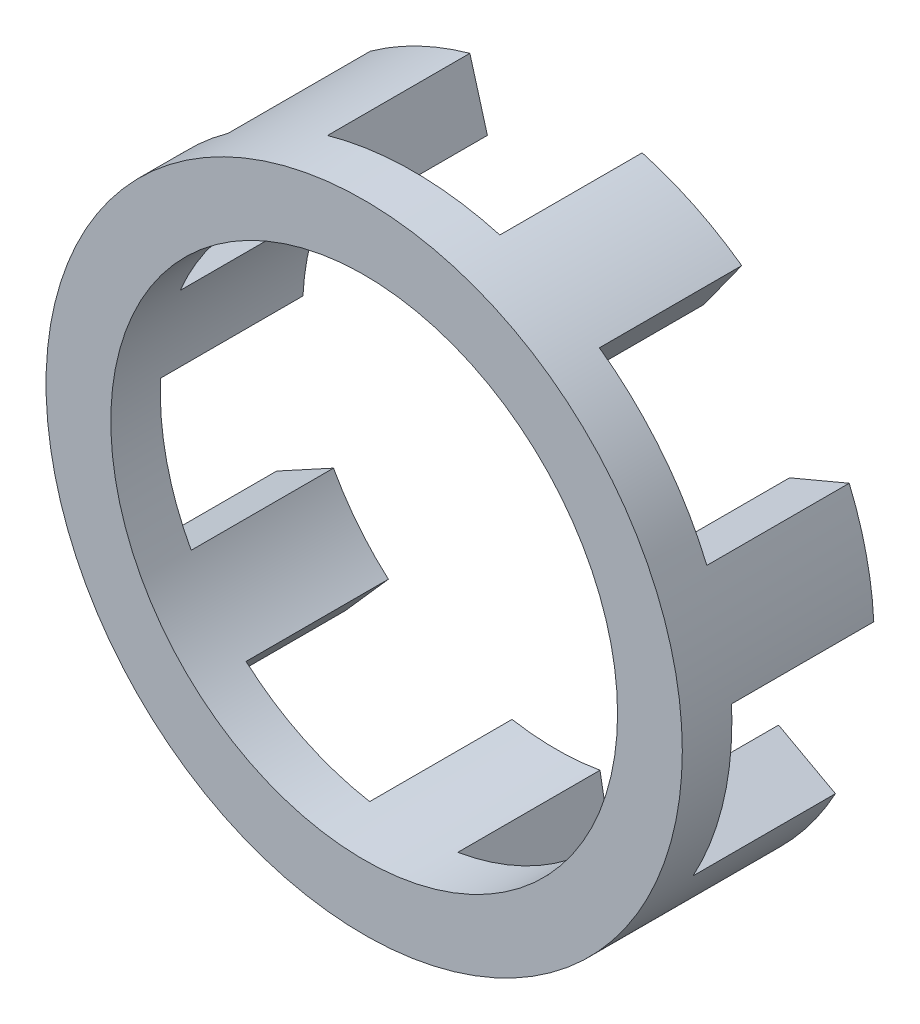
ISO-10303-21;
HEADER;
FILE_DESCRIPTION(('STEP AP214'),'2;1');
FILE_NAME('part.step','',(''),(''),'','','');
FILE_SCHEMA(('AUTOMOTIVE_DESIGN { 1 0 10303 214 1 1 1 1 }'));
ENDSEC;
DATA;
#1=APPLICATION_CONTEXT('core data for automotive mechanical design processes');
#2=APPLICATION_PROTOCOL_DEFINITION('international standard','automotive_design',2000,#1);
#3=PRODUCT_CONTEXT('',#1,'mechanical');
#4=PRODUCT('Part','Part','',(#3));
#5=PRODUCT_RELATED_PRODUCT_CATEGORY('part','',(#4));
#6=PRODUCT_DEFINITION_FORMATION('','',#4);
#7=PRODUCT_DEFINITION_CONTEXT('part definition',#1,'design');
#8=PRODUCT_DEFINITION('design','',#6,#7);
#9=PRODUCT_DEFINITION_SHAPE('','',#8);
#10=(LENGTH_UNIT() NAMED_UNIT(*) SI_UNIT(.MILLI.,.METRE.));
#11=(NAMED_UNIT(*) PLANE_ANGLE_UNIT() SI_UNIT($,.RADIAN.));
#12=(NAMED_UNIT(*) SI_UNIT($,.STERADIAN.) SOLID_ANGLE_UNIT());
#13=UNCERTAINTY_MEASURE_WITH_UNIT(LENGTH_MEASURE(1.E-05),#10,'distance_accuracy_value','');
#14=(GEOMETRIC_REPRESENTATION_CONTEXT(3) GLOBAL_UNCERTAINTY_ASSIGNED_CONTEXT((#13)) GLOBAL_UNIT_ASSIGNED_CONTEXT((#10,
#11,#12)) REPRESENTATION_CONTEXT('',''));
#15=CARTESIAN_POINT('',(0.,0.,0.));
#16=DIRECTION('',(0.,0.,1.));
#17=DIRECTION('',(1.,0.,0.));
#18=AXIS2_PLACEMENT_3D('',#15,#16,#17);
#19=CARTESIAN_POINT('',(-0.0364276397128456,-0.0594127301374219,-1.26999999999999));
#20=DIRECTION('',(0.,0.,1.));
#21=DIRECTION('',(1.,0.,0.));
#22=AXIS2_PLACEMENT_3D('',#19,#20,#21);
#23=PLANE('',#22);
#24=CARTESIAN_POINT('',(-0.0364276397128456,-0.0594127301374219,-1.26999999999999));
#25=DIRECTION('',(0.,0.,1.));
#26=DIRECTION('',(1.,0.,0.));
#27=AXIS2_PLACEMENT_3D('',#24,#25,#26);
#28=CIRCLE('',#27,6.49984127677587);
#29=CARTESIAN_POINT('',(-4.33728055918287,-4.93287154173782,-1.26999999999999));
#30=VERTEX_POINT('',#29);
#31=CARTESIAN_POINT('',(-1.16511323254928,-6.46050681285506,-1.26999999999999));
#32=VERTEX_POINT('',#31);
#33=EDGE_CURVE('E56',#30,#32,#28,.T.);
#34=ORIENTED_EDGE('',*,*,#33,.T.);
#35=DIRECTION('',(0.173648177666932,0.984807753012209,0.));
#36=VECTOR('',#35,1.);
#37=CARTESIAN_POINT('',(-1.16511323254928,-6.46050681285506,-1.26999999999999));
#38=LINE('',#37,#36);
#39=CARTESIAN_POINT('',(-1.45352780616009,-8.09618714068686,-1.26999999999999));
#40=VERTEX_POINT('',#39);
#41=EDGE_CURVE('E244',#40,#32,#38,.T.);
#42=ORIENTED_EDGE('',*,*,#41,.F.);
#43=CARTESIAN_POINT('',(-0.0364276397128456,-0.0594127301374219,-1.26999999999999));
#44=DIRECTION('',(0.,0.,1.));
#45=DIRECTION('',(1.,0.,0.));
#46=AXIS2_PLACEMENT_3D('',#43,#44,#45);
#47=CIRCLE('',#46,8.16075461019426);
#48=CARTESIAN_POINT('',(-5.4362833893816,-6.17819313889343,-1.26999999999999));
#49=VERTEX_POINT('',#48);
#50=EDGE_CURVE('E42',#49,#40,#47,.T.);
#51=ORIENTED_EDGE('',*,*,#50,.F.);
#52=DIRECTION('',(-0.661685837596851,-0.749781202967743,0.));
#53=VECTOR('',#52,1.);
#54=CARTESIAN_POINT('',(-4.33728055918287,-4.93287154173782,-1.26999999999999));
#55=LINE('',#54,#53);
#56=EDGE_CURVE('E375',#30,#49,#55,.T.);
#57=ORIENTED_EDGE('',*,*,#56,.F.);
#58=EDGE_LOOP('',(#34,#42,#51,#57));
#59=FACE_BOUND('',#58,.T.);
#60=ADVANCED_FACE('F38',(#59),#23,.F.);
#61=CARTESIAN_POINT('',(-4.33728055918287,-4.93287154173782,-4.92125000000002));
#62=DIRECTION('',(-0.749781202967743,0.66168583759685,0.));
#63=DIRECTION('',(-0.661685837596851,-0.749781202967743,0.));
#64=AXIS2_PLACEMENT_3D('',#61,#62,#63);
#65=PLANE('',#64);
#66=ORIENTED_EDGE('',*,*,#56,.T.);
#67=DIRECTION('',(0.,0.,1.));
#68=VECTOR('',#67,1.);
#69=CARTESIAN_POINT('',(-5.4362833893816,-6.17819313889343,-4.92125000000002));
#70=LINE('',#69,#68);
#71=CARTESIAN_POINT('',(-5.4362833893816,-6.17819313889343,-4.92125000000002));
#72=VERTEX_POINT('',#71);
#73=EDGE_CURVE('E48',#72,#49,#70,.T.);
#74=ORIENTED_EDGE('',*,*,#73,.F.);
#75=DIRECTION('',(-0.661685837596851,-0.749781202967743,0.));
#76=VECTOR('',#75,1.);
#77=CARTESIAN_POINT('',(-4.33728055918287,-4.93287154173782,-4.92125000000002));
#78=LINE('',#77,#76);
#79=CARTESIAN_POINT('',(-4.33728055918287,-4.93287154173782,-4.92125000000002));
#80=VERTEX_POINT('',#79);
#81=EDGE_CURVE('E398',#80,#72,#78,.T.);
#82=ORIENTED_EDGE('',*,*,#81,.F.);
#83=DIRECTION('',(0.,0.,1.));
#84=VECTOR('',#83,1.);
#85=CARTESIAN_POINT('',(-4.33728055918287,-4.93287154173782,-4.92125000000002));
#86=LINE('',#85,#84);
#87=EDGE_CURVE('E11',#80,#30,#86,.T.);
#88=ORIENTED_EDGE('',*,*,#87,.T.);
#89=EDGE_LOOP('',(#66,#74,#82,#88));
#90=FACE_BOUND('',#89,.T.);
#91=ADVANCED_FACE('F40',(#90),#65,.F.);
#92=CARTESIAN_POINT('',(-5.74472847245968,-3.16798768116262,-4.92125000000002));
#93=DIRECTION('',(0.478253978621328,-0.878221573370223,0.));
#94=DIRECTION('',(0.878221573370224,0.478253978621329,0.));
#95=AXIS2_PLACEMENT_3D('',#92,#93,#94);
#96=PLANE('',#95);
#97=DIRECTION('',(0.878221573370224,0.478253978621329,0.));
#98=VECTOR('',#97,1.);
#99=CARTESIAN_POINT('',(-5.74472847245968,-3.16798768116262,-1.26999999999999));
#100=LINE('',#99,#98);
#101=CARTESIAN_POINT('',(-7.20337839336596,-3.96232609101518,-1.26999999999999));
#102=VERTEX_POINT('',#101);
#103=CARTESIAN_POINT('',(-5.74472847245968,-3.16798768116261,-1.26999999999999));
#104=VERTEX_POINT('',#103);
#105=EDGE_CURVE('E389',#102,#104,#100,.T.);
#106=ORIENTED_EDGE('',*,*,#105,.T.);
#107=DIRECTION('',(0.,0.,1.));
#108=VECTOR('',#107,1.);
#109=CARTESIAN_POINT('',(-5.74472847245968,-3.16798768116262,-4.92125000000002));
#110=LINE('',#109,#108);
#111=CARTESIAN_POINT('',(-5.74472847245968,-3.16798768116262,-4.92125000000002));
#112=VERTEX_POINT('',#111);
#113=EDGE_CURVE('E384',#112,#104,#110,.T.);
#114=ORIENTED_EDGE('',*,*,#113,.F.);
#115=DIRECTION('',(0.878221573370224,0.478253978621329,0.));
#116=VECTOR('',#115,1.);
#117=CARTESIAN_POINT('',(-5.74472847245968,-3.16798768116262,-4.92125000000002));
#118=LINE('',#117,#116);
#119=CARTESIAN_POINT('',(-7.20337839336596,-3.96232609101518,-4.92125000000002));
#120=VERTEX_POINT('',#119);
#121=EDGE_CURVE('E394',#120,#112,#118,.T.);
#122=ORIENTED_EDGE('',*,*,#121,.F.);
#123=DIRECTION('',(0.,0.,1.));
#124=VECTOR('',#123,1.);
#125=CARTESIAN_POINT('',(-7.20337839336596,-3.96232609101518,-4.92125000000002));
#126=LINE('',#125,#124);
#127=EDGE_CURVE('E379',#120,#102,#126,.T.);
#128=ORIENTED_EDGE('',*,*,#127,.T.);
#129=EDGE_LOOP('',(#106,#114,#122,#128));
#130=FACE_BOUND('',#129,.T.);
#131=ADVANCED_FACE('F413',(#130),#96,.F.);
#132=CARTESIAN_POINT('',(-0.0364276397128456,-0.0594127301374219,-4.92124999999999));
#133=DIRECTION('',(0.,0.,-1.));
#134=DIRECTION('',(-0.623489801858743,0.781831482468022,0.));
#135=AXIS2_PLACEMENT_3D('',#132,#133,#134);
#136=PLANE('',#135);
#137=CARTESIAN_POINT('',(-0.0364276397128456,-0.0594127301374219,-4.92124999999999));
#138=DIRECTION('',(0.,0.,1.));
#139=DIRECTION('',(-0.623489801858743,0.781831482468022,0.));
#140=AXIS2_PLACEMENT_3D('',#137,#138,#139);
#141=CIRCLE('',#140,6.49984127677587);
#142=EDGE_CURVE('E311',#112,#80,#141,.T.);
#143=ORIENTED_EDGE('',*,*,#142,.T.);
#144=ORIENTED_EDGE('',*,*,#81,.T.);
#145=CARTESIAN_POINT('',(-0.0364276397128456,-0.0594127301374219,-4.92124999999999));
#146=DIRECTION('',(0.,0.,-1.));
#147=DIRECTION('',(-0.623489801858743,0.781831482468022,0.));
#148=AXIS2_PLACEMENT_3D('',#145,#146,#147);
#149=CIRCLE('',#148,8.16075461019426);
#150=EDGE_CURVE('E397',#72,#120,#149,.T.);
#151=ORIENTED_EDGE('',*,*,#150,.T.);
#152=ORIENTED_EDGE('',*,*,#121,.T.);
#153=EDGE_LOOP('',(#143,#144,#151,#152));
#154=FACE_BOUND('',#153,.T.);
#155=ADVANCED_FACE('F402',(#154),#136,.T.);
#156=CARTESIAN_POINT('',(-6.52818910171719,0.264577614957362,-1.26999999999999));
#157=VERTEX_POINT('',#156);
#158=EDGE_CURVE('E302',#157,#104,#28,.T.);
#159=ORIENTED_EDGE('',*,*,#158,.T.);
#160=ORIENTED_EDGE('',*,*,#105,.F.);
#161=CARTESIAN_POINT('',(-8.1870377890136,0.347367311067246,-1.26999999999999));
#162=VERTEX_POINT('',#161);
#163=EDGE_CURVE('E305',#162,#102,#47,.T.);
#164=ORIENTED_EDGE('',*,*,#163,.F.);
#165=DIRECTION('',(-0.998756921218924,0.0498458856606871,0.));
#166=VECTOR('',#165,1.);
#167=CARTESIAN_POINT('',(-6.52818910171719,0.264577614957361,-1.26999999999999));
#168=LINE('',#167,#166);
#169=EDGE_CURVE('E352',#157,#162,#168,.T.);
#170=ORIENTED_EDGE('',*,*,#169,.F.);
#171=EDGE_LOOP('',(#159,#160,#164,#170));
#172=FACE_BOUND('',#171,.T.);
#173=ADVANCED_FACE('F417',(#172),#23,.F.);
#174=CARTESIAN_POINT('',(-6.52818910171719,0.264577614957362,-4.92125000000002));
#175=DIRECTION('',(0.049845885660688,0.998756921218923,0.));
#176=DIRECTION('',(-0.998756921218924,0.0498458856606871,0.));
#177=AXIS2_PLACEMENT_3D('',#174,#175,#176);
#178=PLANE('',#177);
#179=ORIENTED_EDGE('',*,*,#169,.T.);
#180=DIRECTION('',(0.,0.,1.));
#181=VECTOR('',#180,1.);
#182=CARTESIAN_POINT('',(-8.1870377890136,0.347367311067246,-4.92125000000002));
#183=LINE('',#182,#181);
#184=CARTESIAN_POINT('',(-8.1870377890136,0.347367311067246,-4.92125000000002));
#185=VERTEX_POINT('',#184);
#186=EDGE_CURVE('E357',#185,#162,#183,.T.);
#187=ORIENTED_EDGE('',*,*,#186,.F.);
#188=DIRECTION('',(-0.998756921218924,0.0498458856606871,0.));
#189=VECTOR('',#188,1.);
#190=CARTESIAN_POINT('',(-6.52818910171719,0.264577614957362,-4.92125000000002));
#191=LINE('',#190,#189);
#192=CARTESIAN_POINT('',(-6.52818910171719,0.264577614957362,-4.92125000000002));
#193=VERTEX_POINT('',#192);
#194=EDGE_CURVE('E332',#193,#185,#191,.T.);
#195=ORIENTED_EDGE('',*,*,#194,.F.);
#196=DIRECTION('',(0.,0.,1.));
#197=VECTOR('',#196,1.);
#198=CARTESIAN_POINT('',(-6.52818910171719,0.264577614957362,-4.92125000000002));
#199=LINE('',#198,#197);
#200=EDGE_CURVE('E362',#193,#157,#199,.T.);
#201=ORIENTED_EDGE('',*,*,#200,.T.);
#202=EDGE_LOOP('',(#179,#187,#195,#201));
#203=FACE_BOUND('',#202,.T.);
#204=ADVANCED_FACE('F419',(#203),#178,.F.);
#205=CARTESIAN_POINT('',(-6.02587675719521,2.46535179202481,-4.92124999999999));
#206=DIRECTION('',(-0.388434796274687,-0.921476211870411,0.));
#207=DIRECTION('',(0.921476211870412,-0.388434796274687,0.));
#208=AXIS2_PLACEMENT_3D('',#205,#206,#207);
#209=PLANE('',#208);
#210=DIRECTION('',(0.921476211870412,-0.388434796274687,0.));
#211=VECTOR('',#210,1.);
#212=CARTESIAN_POINT('',(-6.02587675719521,2.46535179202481,-1.26999999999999));
#213=LINE('',#212,#211);
#214=CARTESIAN_POINT('',(-7.55636888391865,3.1105083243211,-1.26999999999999));
#215=VERTEX_POINT('',#214);
#216=CARTESIAN_POINT('',(-6.02587675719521,2.46535179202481,-1.26999999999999));
#217=VERTEX_POINT('',#216);
#218=EDGE_CURVE('E339',#215,#217,#213,.T.);
#219=ORIENTED_EDGE('',*,*,#218,.T.);
#220=DIRECTION('',(0.,0.,1.));
#221=VECTOR('',#220,1.);
#222=CARTESIAN_POINT('',(-6.02587675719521,2.46535179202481,-4.92124999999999));
#223=LINE('',#222,#221);
#224=CARTESIAN_POINT('',(-6.02587675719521,2.46535179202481,-4.92124999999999));
#225=VERTEX_POINT('',#224);
#226=EDGE_CURVE('E342',#225,#217,#223,.T.);
#227=ORIENTED_EDGE('',*,*,#226,.F.);
#228=DIRECTION('',(0.921476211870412,-0.388434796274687,0.));
#229=VECTOR('',#228,1.);
#230=CARTESIAN_POINT('',(-6.02587675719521,2.46535179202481,-4.92124999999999));
#231=LINE('',#230,#229);
#232=CARTESIAN_POINT('',(-7.55636888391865,3.1105083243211,-4.92124999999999));
#233=VERTEX_POINT('',#232);
#234=EDGE_CURVE('E336',#233,#225,#231,.T.);
#235=ORIENTED_EDGE('',*,*,#234,.F.);
#236=DIRECTION('',(0.,0.,1.));
#237=VECTOR('',#236,1.);
#238=CARTESIAN_POINT('',(-7.55636888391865,3.1105083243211,-4.92124999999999));
#239=LINE('',#238,#237);
#240=EDGE_CURVE('E347',#233,#215,#239,.T.);
#241=ORIENTED_EDGE('',*,*,#240,.T.);
#242=EDGE_LOOP('',(#219,#227,#235,#241));
#243=FACE_BOUND('',#242,.T.);
#244=ADVANCED_FACE('F427',(#243),#209,.F.);
#245=CARTESIAN_POINT('',(-0.0364276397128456,-0.0594127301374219,-4.92124999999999));
#246=DIRECTION('',(0.,0.,-1.));
#247=DIRECTION('',(0.222520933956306,0.974927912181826,0.));
#248=AXIS2_PLACEMENT_3D('',#245,#246,#247);
#249=PLANE('',#248);
#250=CARTESIAN_POINT('',(-0.0364276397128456,-0.0594127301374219,-4.92124999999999));
#251=DIRECTION('',(0.,0.,1.));
#252=DIRECTION('',(0.222520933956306,0.974927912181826,0.));
#253=AXIS2_PLACEMENT_3D('',#250,#251,#252);
#254=CIRCLE('',#253,6.49984127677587);
#255=EDGE_CURVE('E310',#225,#193,#254,.T.);
#256=ORIENTED_EDGE('',*,*,#255,.T.);
#257=ORIENTED_EDGE('',*,*,#194,.T.);
#258=CARTESIAN_POINT('',(-0.0364276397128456,-0.0594127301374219,-4.92124999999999));
#259=DIRECTION('',(0.,0.,-1.));
#260=DIRECTION('',(0.222520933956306,0.974927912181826,0.));
#261=AXIS2_PLACEMENT_3D('',#258,#259,#260);
#262=CIRCLE('',#261,8.16075461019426);
#263=EDGE_CURVE('E334',#185,#233,#262,.T.);
#264=ORIENTED_EDGE('',*,*,#263,.T.);
#265=ORIENTED_EDGE('',*,*,#234,.T.);
#266=EDGE_LOOP('',(#256,#257,#264,#265));
#267=FACE_BOUND('',#266,.T.);
#268=ADVANCED_FACE('F424',(#267),#249,.T.);
#269=CARTESIAN_POINT('',(-3.8306688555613,5.21805543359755,-1.26999999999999));
#270=VERTEX_POINT('',#269);
#271=EDGE_CURVE('E298',#270,#217,#28,.T.);
#272=ORIENTED_EDGE('',*,*,#271,.T.);
#273=ORIENTED_EDGE('',*,*,#218,.F.);
#274=CARTESIAN_POINT('',(-4.80021650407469,6.56661409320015,-1.26999999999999));
#275=VERTEX_POINT('',#274);
#276=EDGE_CURVE('E328',#275,#215,#47,.T.);
#277=ORIENTED_EDGE('',*,*,#276,.F.);
#278=DIRECTION('',(-0.583743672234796,0.811938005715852,0.));
#279=VECTOR('',#278,1.);
#280=CARTESIAN_POINT('',(-3.8306688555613,5.21805543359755,-1.26999999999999));
#281=LINE('',#280,#279);
#282=EDGE_CURVE('E435',#270,#275,#281,.T.);
#283=ORIENTED_EDGE('',*,*,#282,.F.);
#284=EDGE_LOOP('',(#272,#273,#277,#283));
#285=FACE_BOUND('',#284,.T.);
#286=ADVANCED_FACE('F436',(#285),#23,.F.);
#287=CARTESIAN_POINT('',(-3.8306688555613,5.21805543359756,-4.92124999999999));
#288=DIRECTION('',(0.811938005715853,0.583743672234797,0.));
#289=DIRECTION('',(-0.583743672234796,0.811938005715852,0.));
#290=AXIS2_PLACEMENT_3D('',#287,#288,#289);
#291=PLANE('',#290);
#292=ORIENTED_EDGE('',*,*,#282,.T.);
#293=DIRECTION('',(0.,0.,1.));
#294=VECTOR('',#293,1.);
#295=CARTESIAN_POINT('',(-4.80021650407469,6.56661409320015,-4.92124999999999));
#296=LINE('',#295,#294);
#297=CARTESIAN_POINT('',(-4.80021650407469,6.56661409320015,-4.92124999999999));
#298=VERTEX_POINT('',#297);
#299=EDGE_CURVE('E440',#298,#275,#296,.T.);
#300=ORIENTED_EDGE('',*,*,#299,.F.);
#301=DIRECTION('',(-0.583743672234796,0.811938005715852,0.));
#302=VECTOR('',#301,1.);
#303=CARTESIAN_POINT('',(-3.8306688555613,5.21805543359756,-4.92124999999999));
#304=LINE('',#303,#302);
#305=CARTESIAN_POINT('',(-3.8306688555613,5.21805543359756,-4.92124999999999));
#306=VERTEX_POINT('',#305);
#307=EDGE_CURVE('E445',#306,#298,#304,.T.);
#308=ORIENTED_EDGE('',*,*,#307,.F.);
#309=DIRECTION('',(0.,0.,1.));
#310=VECTOR('',#309,1.);
#311=CARTESIAN_POINT('',(-3.8306688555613,5.21805543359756,-4.92124999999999));
#312=LINE('',#311,#310);
#313=EDGE_CURVE('E306',#306,#270,#312,.T.);
#314=ORIENTED_EDGE('',*,*,#313,.T.);
#315=EDGE_LOOP('',(#292,#300,#308,#314));
#316=FACE_BOUND('',#315,.T.);
#317=ADVANCED_FACE('F444',(#316),#291,.F.);
#318=CARTESIAN_POINT('',(-1.79684769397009,6.19749208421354,-4.92124999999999));
#319=DIRECTION('',(-0.962624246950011,-0.270840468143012,0.));
#320=DIRECTION('',(0.270840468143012,-0.962624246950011,0.));
#321=AXIS2_PLACEMENT_3D('',#318,#319,#320);
#322=PLANE('',#321);
#323=DIRECTION('',(0.270840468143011,-0.96262424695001,0.));
#324=VECTOR('',#323,1.);
#325=CARTESIAN_POINT('',(-1.79684769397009,6.19749208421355,-1.26999999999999));
#326=LINE('',#325,#324);
#327=CARTESIAN_POINT('',(-2.2466902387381,7.79632753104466,-1.26999999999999));
#328=VERTEX_POINT('',#327);
#329=CARTESIAN_POINT('',(-1.79684769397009,6.19749208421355,-1.26999999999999));
#330=VERTEX_POINT('',#329);
#331=EDGE_CURVE('E463',#328,#330,#326,.T.);
#332=ORIENTED_EDGE('',*,*,#331,.T.);
#333=DIRECTION('',(0.,0.,1.));
#334=VECTOR('',#333,1.);
#335=CARTESIAN_POINT('',(-1.79684769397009,6.19749208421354,-4.92124999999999));
#336=LINE('',#335,#334);
#337=CARTESIAN_POINT('',(-1.79684769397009,6.19749208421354,-4.92124999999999));
#338=VERTEX_POINT('',#337);
#339=EDGE_CURVE('E458',#338,#330,#336,.T.);
#340=ORIENTED_EDGE('',*,*,#339,.F.);
#341=DIRECTION('',(0.270840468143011,-0.96262424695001,0.));
#342=VECTOR('',#341,1.);
#343=CARTESIAN_POINT('',(-1.79684769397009,6.19749208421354,-4.92124999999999));
#344=LINE('',#343,#342);
#345=CARTESIAN_POINT('',(-2.2466902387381,7.79632753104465,-4.92124999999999));
#346=VERTEX_POINT('',#345);
#347=EDGE_CURVE('E468',#346,#338,#344,.T.);
#348=ORIENTED_EDGE('',*,*,#347,.F.);
#349=DIRECTION('',(0.,0.,1.));
#350=VECTOR('',#349,1.);
#351=CARTESIAN_POINT('',(-2.2466902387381,7.79632753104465,-4.92124999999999));
#352=LINE('',#351,#350);
#353=EDGE_CURVE('E441',#346,#328,#352,.T.);
#354=ORIENTED_EDGE('',*,*,#353,.T.);
#355=EDGE_LOOP('',(#332,#340,#348,#354));
#356=FACE_BOUND('',#355,.T.);
#357=ADVANCED_FACE('F481',(#356),#322,.F.);
#358=CARTESIAN_POINT('',(-0.0364276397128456,-0.0594127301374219,-4.92124999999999));
#359=DIRECTION('',(0.,0.,-1.));
#360=DIRECTION('',(0.900968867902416,0.433883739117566,0.));
#361=AXIS2_PLACEMENT_3D('',#358,#359,#360);
#362=PLANE('',#361);
#363=CARTESIAN_POINT('',(-0.0364276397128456,-0.0594127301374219,-4.92124999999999));
#364=DIRECTION('',(0.,0.,1.));
#365=DIRECTION('',(0.900968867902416,0.433883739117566,0.));
#366=AXIS2_PLACEMENT_3D('',#363,#364,#365);
#367=CIRCLE('',#366,6.49984127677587);
#368=EDGE_CURVE('E330',#338,#306,#367,.T.);
#369=ORIENTED_EDGE('',*,*,#368,.T.);
#370=ORIENTED_EDGE('',*,*,#307,.T.);
#371=CARTESIAN_POINT('',(-0.0364276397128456,-0.0594127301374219,-4.92124999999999));
#372=DIRECTION('',(0.,0.,-1.));
#373=DIRECTION('',(0.900968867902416,0.433883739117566,0.));
#374=AXIS2_PLACEMENT_3D('',#371,#372,#373);
#375=CIRCLE('',#374,8.16075461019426);
#376=EDGE_CURVE('E471',#298,#346,#375,.T.);
#377=ORIENTED_EDGE('',*,*,#376,.T.);
#378=ORIENTED_EDGE('',*,*,#347,.T.);
#379=EDGE_LOOP('',(#369,#370,#377,#378));
#380=FACE_BOUND('',#379,.T.);
#381=ADVANCED_FACE('F474',(#380),#362,.T.);
#382=CARTESIAN_POINT('',(1.72399241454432,6.19749208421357,-1.26999999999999));
#383=VERTEX_POINT('',#382);
#384=EDGE_CURVE('E294',#383,#330,#28,.T.);
#385=ORIENTED_EDGE('',*,*,#384,.T.);
#386=ORIENTED_EDGE('',*,*,#331,.F.);
#387=CARTESIAN_POINT('',(2.17383495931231,7.79632753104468,-1.26999999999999));
#388=VERTEX_POINT('',#387);
#389=EDGE_CURVE('E326',#388,#328,#47,.T.);
#390=ORIENTED_EDGE('',*,*,#389,.F.);
#391=DIRECTION('',(0.270840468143,0.962624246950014,0.));
#392=VECTOR('',#391,1.);
#393=CARTESIAN_POINT('',(1.72399241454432,6.19749208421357,-1.26999999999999));
#394=LINE('',#393,#392);
#395=EDGE_CURVE('E487',#383,#388,#394,.T.);
#396=ORIENTED_EDGE('',*,*,#395,.F.);
#397=EDGE_LOOP('',(#385,#386,#390,#396));
#398=FACE_BOUND('',#397,.T.);
#399=ADVANCED_FACE('F485',(#398),#23,.F.);
#400=CARTESIAN_POINT('',(1.72399241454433,6.19749208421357,-4.92124999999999));
#401=DIRECTION('',(0.962624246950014,-0.270840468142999,0.));
#402=DIRECTION('',(0.270840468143,0.962624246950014,0.));
#403=AXIS2_PLACEMENT_3D('',#400,#401,#402);
#404=PLANE('',#403);
#405=ORIENTED_EDGE('',*,*,#395,.T.);
#406=DIRECTION('',(0.,0.,1.));
#407=VECTOR('',#406,1.);
#408=CARTESIAN_POINT('',(2.17383495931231,7.79632753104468,-4.92124999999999));
#409=LINE('',#408,#407);
#410=CARTESIAN_POINT('',(2.17383495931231,7.79632753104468,-4.92124999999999));
#411=VERTEX_POINT('',#410);
#412=EDGE_CURVE('E864',#411,#388,#409,.T.);
#413=ORIENTED_EDGE('',*,*,#412,.F.);
#414=DIRECTION('',(0.270840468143,0.962624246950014,0.));
#415=VECTOR('',#414,1.);
#416=CARTESIAN_POINT('',(1.72399241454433,6.19749208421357,-4.92124999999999));
#417=LINE('',#416,#415);
#418=CARTESIAN_POINT('',(1.72399241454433,6.19749208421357,-4.92124999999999));
#419=VERTEX_POINT('',#418);
#420=EDGE_CURVE('E881',#419,#411,#417,.T.);
#421=ORIENTED_EDGE('',*,*,#420,.F.);
#422=DIRECTION('',(0.,0.,1.));
#423=VECTOR('',#422,1.);
#424=CARTESIAN_POINT('',(1.72399241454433,6.19749208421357,-4.92124999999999));
#425=LINE('',#424,#423);
#426=EDGE_CURVE('E433',#419,#383,#425,.T.);
#427=ORIENTED_EDGE('',*,*,#426,.T.);
#428=EDGE_LOOP('',(#405,#413,#421,#427));
#429=FACE_BOUND('',#428,.T.);
#430=ADVANCED_FACE('F630',(#429),#404,.F.);
#431=CARTESIAN_POINT('',(3.75781357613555,5.21805543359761,-4.92124999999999));
#432=DIRECTION('',(-0.81193800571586,0.583743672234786,0.));
#433=DIRECTION('',(-0.583743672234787,-0.81193800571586,0.));
#434=AXIS2_PLACEMENT_3D('',#431,#432,#433);
#435=PLANE('',#434);
#436=DIRECTION('',(-0.583743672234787,-0.81193800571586,0.));
#437=VECTOR('',#436,1.);
#438=CARTESIAN_POINT('',(3.75781357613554,5.21805543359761,-1.26999999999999));
#439=LINE('',#438,#437);
#440=CARTESIAN_POINT('',(4.72736122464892,6.56661409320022,-1.26999999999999));
#441=VERTEX_POINT('',#440);
#442=CARTESIAN_POINT('',(3.75781357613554,5.21805543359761,-1.26999999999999));
#443=VERTEX_POINT('',#442);
#444=EDGE_CURVE('E852',#441,#443,#439,.T.);
#445=ORIENTED_EDGE('',*,*,#444,.T.);
#446=DIRECTION('',(0.,0.,1.));
#447=VECTOR('',#446,1.);
#448=CARTESIAN_POINT('',(3.75781357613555,5.21805543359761,-4.92124999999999));
#449=LINE('',#448,#447);
#450=CARTESIAN_POINT('',(3.75781357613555,5.21805543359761,-4.92124999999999));
#451=VERTEX_POINT('',#450);
#452=EDGE_CURVE('E856',#451,#443,#449,.T.);
#453=ORIENTED_EDGE('',*,*,#452,.F.);
#454=DIRECTION('',(-0.583743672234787,-0.81193800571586,0.));
#455=VECTOR('',#454,1.);
#456=CARTESIAN_POINT('',(3.75781357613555,5.21805543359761,-4.92124999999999));
#457=LINE('',#456,#455);
#458=CARTESIAN_POINT('',(4.72736122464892,6.56661409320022,-4.92124999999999));
#459=VERTEX_POINT('',#458);
#460=EDGE_CURVE('E857',#459,#451,#457,.T.);
#461=ORIENTED_EDGE('',*,*,#460,.F.);
#462=DIRECTION('',(0.,0.,1.));
#463=VECTOR('',#462,1.);
#464=CARTESIAN_POINT('',(4.72736122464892,6.56661409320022,-4.92124999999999));
#465=LINE('',#464,#463);
#466=EDGE_CURVE('E860',#459,#441,#465,.T.);
#467=ORIENTED_EDGE('',*,*,#466,.T.);
#468=EDGE_LOOP('',(#445,#453,#461,#467));
#469=FACE_BOUND('',#468,.T.);
#470=ADVANCED_FACE('F626',(#469),#435,.F.);
#471=CARTESIAN_POINT('',(-0.0364276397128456,-0.0594127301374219,-4.92124999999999));
#472=DIRECTION('',(0.,0.,-1.));
#473=DIRECTION('',(0.900968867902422,-0.433883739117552,0.));
#474=AXIS2_PLACEMENT_3D('',#471,#472,#473);
#475=PLANE('',#474);
#476=CARTESIAN_POINT('',(-0.0364276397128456,-0.0594127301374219,-4.92124999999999));
#477=DIRECTION('',(0.,0.,1.));
#478=DIRECTION('',(0.900968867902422,-0.433883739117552,0.));
#479=AXIS2_PLACEMENT_3D('',#476,#477,#478);
#480=CIRCLE('',#479,6.49984127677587);
#481=EDGE_CURVE('E490',#451,#419,#480,.T.);
#482=ORIENTED_EDGE('',*,*,#481,.T.);
#483=ORIENTED_EDGE('',*,*,#420,.T.);
#484=CARTESIAN_POINT('',(-0.0364276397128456,-0.0594127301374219,-4.92124999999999));
#485=DIRECTION('',(0.,0.,-1.));
#486=DIRECTION('',(0.900968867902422,-0.433883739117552,0.));
#487=AXIS2_PLACEMENT_3D('',#484,#485,#486);
#488=CIRCLE('',#487,8.16075461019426);
#489=EDGE_CURVE('E882',#411,#459,#488,.T.);
#490=ORIENTED_EDGE('',*,*,#489,.T.);
#491=ORIENTED_EDGE('',*,*,#460,.T.);
#492=EDGE_LOOP('',(#482,#483,#490,#491));
#493=FACE_BOUND('',#492,.T.);
#494=ADVANCED_FACE('F620',(#493),#475,.T.);
#495=CARTESIAN_POINT('',(5.95302147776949,2.46535179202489,-1.26999999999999));
#496=VERTEX_POINT('',#495);
#497=EDGE_CURVE('E289',#496,#443,#28,.T.);
#498=ORIENTED_EDGE('',*,*,#497,.T.);
#499=ORIENTED_EDGE('',*,*,#444,.F.);
#500=CARTESIAN_POINT('',(7.48351360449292,3.1105083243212,-1.26999999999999));
#501=VERTEX_POINT('',#500);
#502=EDGE_CURVE('E323',#501,#441,#47,.T.);
#503=ORIENTED_EDGE('',*,*,#502,.F.);
#504=DIRECTION('',(0.921476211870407,0.388434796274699,0.));
#505=VECTOR('',#504,1.);
#506=CARTESIAN_POINT('',(5.95302147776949,2.46535179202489,-1.26999999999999));
#507=LINE('',#506,#505);
#508=EDGE_CURVE('E499',#496,#501,#507,.T.);
#509=ORIENTED_EDGE('',*,*,#508,.F.);
#510=EDGE_LOOP('',(#498,#499,#503,#509));
#511=FACE_BOUND('',#510,.T.);
#512=ADVANCED_FACE('F610',(#511),#23,.F.);
#513=CARTESIAN_POINT('',(5.95302147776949,2.46535179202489,-4.92124999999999));
#514=DIRECTION('',(0.388434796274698,-0.921476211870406,0.));
#515=DIRECTION('',(0.921476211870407,0.388434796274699,0.));
#516=AXIS2_PLACEMENT_3D('',#513,#514,#515);
#517=PLANE('',#516);
#518=ORIENTED_EDGE('',*,*,#508,.T.);
#519=DIRECTION('',(0.,0.,1.));
#520=VECTOR('',#519,1.);
#521=CARTESIAN_POINT('',(7.48351360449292,3.1105083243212,-4.92124999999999));
#522=LINE('',#521,#520);
#523=CARTESIAN_POINT('',(7.48351360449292,3.1105083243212,-4.92124999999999));
#524=VERTEX_POINT('',#523);
#525=EDGE_CURVE('E492',#524,#501,#522,.T.);
#526=ORIENTED_EDGE('',*,*,#525,.F.);
#527=DIRECTION('',(0.921476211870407,0.388434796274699,0.));
#528=VECTOR('',#527,1.);
#529=CARTESIAN_POINT('',(5.95302147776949,2.46535179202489,-4.92124999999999));
#530=LINE('',#529,#528);
#531=CARTESIAN_POINT('',(5.95302147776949,2.46535179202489,-4.92124999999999));
#532=VERTEX_POINT('',#531);
#533=EDGE_CURVE('E528',#532,#524,#530,.T.);
#534=ORIENTED_EDGE('',*,*,#533,.F.);
#535=DIRECTION('',(0.,0.,1.));
#536=VECTOR('',#535,1.);
#537=CARTESIAN_POINT('',(5.95302147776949,2.46535179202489,-4.92124999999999));
#538=LINE('',#537,#536);
#539=EDGE_CURVE('E489',#532,#496,#538,.T.);
#540=ORIENTED_EDGE('',*,*,#539,.T.);
#541=EDGE_LOOP('',(#518,#526,#534,#540));
#542=FACE_BOUND('',#541,.T.);
#543=ADVANCED_FACE('F619',(#542),#517,.F.);
#544=CARTESIAN_POINT('',(6.45533382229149,0.264577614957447,-4.92124999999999));
#545=DIRECTION('',(-0.0498458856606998,0.998756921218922,0.));
#546=DIRECTION('',(-0.998756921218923,-0.0498458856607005,0.));
#547=AXIS2_PLACEMENT_3D('',#544,#545,#546);
#548=PLANE('',#547);
#549=DIRECTION('',(-0.998756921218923,-0.0498458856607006,0.));
#550=VECTOR('',#549,1.);
#551=CARTESIAN_POINT('',(6.45533382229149,0.264577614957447,-1.26999999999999));
#552=LINE('',#551,#550);
#553=CARTESIAN_POINT('',(8.11418250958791,0.347367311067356,-1.26999999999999));
#554=VERTEX_POINT('',#553);
#555=CARTESIAN_POINT('',(6.45533382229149,0.264577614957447,-1.26999999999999));
#556=VERTEX_POINT('',#555);
#557=EDGE_CURVE('E518',#554,#556,#552,.T.);
#558=ORIENTED_EDGE('',*,*,#557,.T.);
#559=DIRECTION('',(0.,0.,1.));
#560=VECTOR('',#559,1.);
#561=CARTESIAN_POINT('',(6.45533382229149,0.264577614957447,-4.92124999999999));
#562=LINE('',#561,#560);
#563=CARTESIAN_POINT('',(6.45533382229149,0.264577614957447,-4.92124999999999));
#564=VERTEX_POINT('',#563);
#565=EDGE_CURVE('E513',#564,#556,#562,.T.);
#566=ORIENTED_EDGE('',*,*,#565,.F.);
#567=DIRECTION('',(-0.998756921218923,-0.0498458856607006,0.));
#568=VECTOR('',#567,1.);
#569=CARTESIAN_POINT('',(6.45533382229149,0.264577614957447,-4.92124999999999));
#570=LINE('',#569,#568);
#571=CARTESIAN_POINT('',(8.11418250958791,0.347367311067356,-4.92124999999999));
#572=VERTEX_POINT('',#571);
#573=EDGE_CURVE('E523',#572,#564,#570,.T.);
#574=ORIENTED_EDGE('',*,*,#573,.F.);
#575=DIRECTION('',(0.,0.,1.));
#576=VECTOR('',#575,1.);
#577=CARTESIAN_POINT('',(8.11418250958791,0.347367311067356,-4.92124999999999));
#578=LINE('',#577,#576);
#579=EDGE_CURVE('E508',#572,#554,#578,.T.);
#580=ORIENTED_EDGE('',*,*,#579,.T.);
#581=EDGE_LOOP('',(#558,#566,#574,#580));
#582=FACE_BOUND('',#581,.T.);
#583=ADVANCED_FACE('F616',(#582),#548,.F.);
#584=CARTESIAN_POINT('',(-0.0364276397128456,-0.0594127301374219,-4.92124999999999));
#585=DIRECTION('',(0.,0.,-1.));
#586=DIRECTION('',(0.222520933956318,-0.974927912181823,0.));
#587=AXIS2_PLACEMENT_3D('',#584,#585,#586);
#588=PLANE('',#587);
#589=CARTESIAN_POINT('',(-0.0364276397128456,-0.0594127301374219,-4.92124999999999));
#590=DIRECTION('',(0.,0.,1.));
#591=DIRECTION('',(0.222520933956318,-0.974927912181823,0.));
#592=AXIS2_PLACEMENT_3D('',#589,#590,#591);
#593=CIRCLE('',#592,6.49984127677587);
#594=EDGE_CURVE('E529',#564,#532,#593,.T.);
#595=ORIENTED_EDGE('',*,*,#594,.T.);
#596=ORIENTED_EDGE('',*,*,#533,.T.);
#597=CARTESIAN_POINT('',(-0.0364276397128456,-0.0594127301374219,-4.92124999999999));
#598=DIRECTION('',(0.,0.,-1.));
#599=DIRECTION('',(0.222520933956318,-0.974927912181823,0.));
#600=AXIS2_PLACEMENT_3D('',#597,#598,#599);
#601=CIRCLE('',#600,8.16075461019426);
#602=EDGE_CURVE('E526',#524,#572,#601,.T.);
#603=ORIENTED_EDGE('',*,*,#602,.T.);
#604=ORIENTED_EDGE('',*,*,#573,.T.);
#605=EDGE_LOOP('',(#595,#596,#603,#604));
#606=FACE_BOUND('',#605,.T.);
#607=ADVANCED_FACE('F608',(#606),#588,.T.);
#608=CARTESIAN_POINT('',(5.67187319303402,-3.16798768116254,-1.26999999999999));
#609=VERTEX_POINT('',#608);
#610=EDGE_CURVE('E284',#609,#556,#28,.T.);
#611=ORIENTED_EDGE('',*,*,#610,.T.);
#612=ORIENTED_EDGE('',*,*,#557,.F.);
#613=CARTESIAN_POINT('',(7.13052311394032,-3.96232609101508,-1.26999999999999));
#614=VERTEX_POINT('',#613);
#615=EDGE_CURVE('E320',#614,#554,#47,.T.);
#616=ORIENTED_EDGE('',*,*,#615,.F.);
#617=DIRECTION('',(0.87822157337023,-0.478253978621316,0.));
#618=VECTOR('',#617,1.);
#619=CARTESIAN_POINT('',(5.67187319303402,-3.16798768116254,-1.26999999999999));
#620=LINE('',#619,#618);
#621=EDGE_CURVE('E545',#609,#614,#620,.T.);
#622=ORIENTED_EDGE('',*,*,#621,.F.);
#623=EDGE_LOOP('',(#611,#612,#616,#622));
#624=FACE_BOUND('',#623,.T.);
#625=ADVANCED_FACE('F596',(#624),#23,.F.);
#626=CARTESIAN_POINT('',(5.67187319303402,-3.16798768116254,-4.92125000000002));
#627=DIRECTION('',(-0.478253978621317,-0.87822157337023,0.));
#628=DIRECTION('',(0.87822157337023,-0.478253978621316,0.));
#629=AXIS2_PLACEMENT_3D('',#626,#627,#628);
#630=PLANE('',#629);
#631=ORIENTED_EDGE('',*,*,#621,.T.);
#632=DIRECTION('',(0.,0.,1.));
#633=VECTOR('',#632,1.);
#634=CARTESIAN_POINT('',(7.13052311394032,-3.96232609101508,-4.92125000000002));
#635=LINE('',#634,#633);
#636=CARTESIAN_POINT('',(7.13052311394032,-3.96232609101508,-4.92125000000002));
#637=VERTEX_POINT('',#636);
#638=EDGE_CURVE('E538',#637,#614,#635,.T.);
#639=ORIENTED_EDGE('',*,*,#638,.F.);
#640=DIRECTION('',(0.87822157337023,-0.478253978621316,0.));
#641=VECTOR('',#640,1.);
#642=CARTESIAN_POINT('',(5.67187319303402,-3.16798768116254,-4.92125000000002));
#643=LINE('',#642,#641);
#644=CARTESIAN_POINT('',(5.67187319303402,-3.16798768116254,-4.92125000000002));
#645=VERTEX_POINT('',#644);
#646=EDGE_CURVE('E573',#645,#637,#643,.T.);
#647=ORIENTED_EDGE('',*,*,#646,.F.);
#648=DIRECTION('',(0.,0.,1.));
#649=VECTOR('',#648,1.);
#650=CARTESIAN_POINT('',(5.67187319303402,-3.16798768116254,-4.92125000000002));
#651=LINE('',#650,#649);
#652=EDGE_CURVE('E533',#645,#609,#651,.T.);
#653=ORIENTED_EDGE('',*,*,#652,.T.);
#654=EDGE_LOOP('',(#631,#639,#647,#653));
#655=FACE_BOUND('',#654,.T.);
#656=ADVANCED_FACE('F607',(#655),#630,.F.);
#657=CARTESIAN_POINT('',(4.26442527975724,-4.93287154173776,-4.92125000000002));
#658=DIRECTION('',(0.749781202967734,0.661685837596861,0.));
#659=DIRECTION('',(-0.66168583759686,0.749781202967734,0.));
#660=AXIS2_PLACEMENT_3D('',#657,#658,#659);
#661=PLANE('',#660);
#662=DIRECTION('',(-0.66168583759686,0.749781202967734,0.));
#663=VECTOR('',#662,1.);
#664=CARTESIAN_POINT('',(4.26442527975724,-4.93287154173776,-1.26999999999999));
#665=LINE('',#664,#663);
#666=CARTESIAN_POINT('',(5.36342810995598,-6.17819313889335,-1.26999999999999));
#667=VERTEX_POINT('',#666);
#668=CARTESIAN_POINT('',(4.26442527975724,-4.93287154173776,-1.26999999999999));
#669=VERTEX_POINT('',#668);
#670=EDGE_CURVE('E563',#667,#669,#665,.T.);
#671=ORIENTED_EDGE('',*,*,#670,.T.);
#672=DIRECTION('',(0.,0.,1.));
#673=VECTOR('',#672,1.);
#674=CARTESIAN_POINT('',(4.26442527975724,-4.93287154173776,-4.92125000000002));
#675=LINE('',#674,#673);
#676=CARTESIAN_POINT('',(4.26442527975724,-4.93287154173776,-4.92125000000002));
#677=VERTEX_POINT('',#676);
#678=EDGE_CURVE('E559',#677,#669,#675,.T.);
#679=ORIENTED_EDGE('',*,*,#678,.F.);
#680=DIRECTION('',(-0.66168583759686,0.749781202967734,0.));
#681=VECTOR('',#680,1.);
#682=CARTESIAN_POINT('',(4.26442527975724,-4.93287154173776,-4.92125000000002));
#683=LINE('',#682,#681);
#684=CARTESIAN_POINT('',(5.36342810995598,-6.17819313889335,-4.92125000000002));
#685=VERTEX_POINT('',#684);
#686=EDGE_CURVE('E568',#685,#677,#683,.T.);
#687=ORIENTED_EDGE('',*,*,#686,.F.);
#688=DIRECTION('',(0.,0.,1.));
#689=VECTOR('',#688,1.);
#690=CARTESIAN_POINT('',(5.36342810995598,-6.17819313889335,-4.92125000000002));
#691=LINE('',#690,#689);
#692=EDGE_CURVE('E554',#685,#667,#691,.T.);
#693=ORIENTED_EDGE('',*,*,#692,.T.);
#694=EDGE_LOOP('',(#671,#679,#687,#693));
#695=FACE_BOUND('',#694,.T.);
#696=ADVANCED_FACE('F603',(#695),#661,.F.);
#697=CARTESIAN_POINT('',(-0.0364276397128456,-0.0594127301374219,-4.92124999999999));
#698=DIRECTION('',(0.,0.,-1.));
#699=DIRECTION('',(-0.623489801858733,-0.781831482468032,0.));
#700=AXIS2_PLACEMENT_3D('',#697,#698,#699);
#701=PLANE('',#700);
#702=CARTESIAN_POINT('',(-0.0364276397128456,-0.0594127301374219,-4.92124999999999));
#703=DIRECTION('',(0.,0.,1.));
#704=DIRECTION('',(-0.623489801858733,-0.781831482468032,0.));
#705=AXIS2_PLACEMENT_3D('',#702,#703,#704);
#706=CIRCLE('',#705,6.49984127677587);
#707=EDGE_CURVE('E575',#677,#645,#706,.T.);
#708=ORIENTED_EDGE('',*,*,#707,.T.);
#709=ORIENTED_EDGE('',*,*,#646,.T.);
#710=CARTESIAN_POINT('',(-0.0364276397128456,-0.0594127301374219,-4.92124999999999));
#711=DIRECTION('',(0.,0.,-1.));
#712=DIRECTION('',(-0.623489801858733,-0.781831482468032,0.));
#713=AXIS2_PLACEMENT_3D('',#710,#711,#712);
#714=CIRCLE('',#713,8.16075461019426);
#715=EDGE_CURVE('E571',#637,#685,#714,.T.);
#716=ORIENTED_EDGE('',*,*,#715,.T.);
#717=ORIENTED_EDGE('',*,*,#686,.T.);
#718=EDGE_LOOP('',(#708,#709,#716,#717));
#719=FACE_BOUND('',#718,.T.);
#720=ADVANCED_FACE('F594',(#719),#701,.T.);
#721=CARTESIAN_POINT('',(1.09225795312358,-6.46050681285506,-1.26999999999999));
#722=VERTEX_POINT('',#721);
#723=EDGE_CURVE('E250',#722,#669,#28,.T.);
#724=ORIENTED_EDGE('',*,*,#723,.T.);
#725=ORIENTED_EDGE('',*,*,#670,.F.);
#726=CARTESIAN_POINT('',(1.38067252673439,-8.09618714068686,-1.26999999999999));
#727=VERTEX_POINT('',#726);
#728=EDGE_CURVE('E276',#727,#667,#47,.T.);
#729=ORIENTED_EDGE('',*,*,#728,.F.);
#730=DIRECTION('',(0.17364817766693,-0.984807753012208,0.));
#731=VECTOR('',#730,1.);
#732=CARTESIAN_POINT('',(1.09225795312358,-6.46050681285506,-1.26999999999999));
#733=LINE('',#732,#731);
#734=EDGE_CURVE('E265',#722,#727,#733,.T.);
#735=ORIENTED_EDGE('',*,*,#734,.F.);
#736=EDGE_LOOP('',(#724,#725,#729,#735));
#737=FACE_BOUND('',#736,.T.);
#738=ADVANCED_FACE('F586',(#737),#23,.F.);
#739=CARTESIAN_POINT('',(-0.0364276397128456,-0.0594127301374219,-1.26999999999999));
#740=DIRECTION('',(0.,0.,1.));
#741=DIRECTION('',(1.,0.,0.));
#742=AXIS2_PLACEMENT_3D('',#739,#740,#741);
#743=CYLINDRICAL_SURFACE('',#742,8.16075461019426);
#744=ORIENTED_EDGE('',*,*,#163,.T.);
#745=ORIENTED_EDGE('',*,*,#127,.F.);
#746=ORIENTED_EDGE('',*,*,#150,.F.);
#747=ORIENTED_EDGE('',*,*,#73,.T.);
#748=ORIENTED_EDGE('',*,*,#50,.T.);
#749=DIRECTION('',(0.,0.,1.));
#750=VECTOR('',#749,1.);
#751=CARTESIAN_POINT('',(-1.45352780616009,-8.09618714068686,-4.92125000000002));
#752=LINE('',#751,#750);
#753=CARTESIAN_POINT('',(-1.45352780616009,-8.09618714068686,-4.92125000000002));
#754=VERTEX_POINT('',#753);
#755=EDGE_CURVE('E255',#754,#40,#752,.T.);
#756=ORIENTED_EDGE('',*,*,#755,.F.);
#757=CARTESIAN_POINT('',(-0.0364276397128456,-0.0594127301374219,-4.92124999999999));
#758=DIRECTION('',(0.,0.,-1.));
#759=DIRECTION('',(-1.,0.,0.));
#760=AXIS2_PLACEMENT_3D('',#757,#758,#759);
#761=CIRCLE('',#760,8.16075461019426);
#762=CARTESIAN_POINT('',(1.38067252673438,-8.09618714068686,-4.92125000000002));
#763=VERTEX_POINT('',#762);
#764=EDGE_CURVE('E236',#763,#754,#761,.T.);
#765=ORIENTED_EDGE('',*,*,#764,.F.);
#766=DIRECTION('',(0.,0.,1.));
#767=VECTOR('',#766,1.);
#768=CARTESIAN_POINT('',(1.38067252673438,-8.09618714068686,-4.92125000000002));
#769=LINE('',#768,#767);
#770=EDGE_CURVE('E233',#763,#727,#769,.T.);
#771=ORIENTED_EDGE('',*,*,#770,.T.);
#772=ORIENTED_EDGE('',*,*,#728,.T.);
#773=ORIENTED_EDGE('',*,*,#692,.F.);
#774=ORIENTED_EDGE('',*,*,#715,.F.);
#775=ORIENTED_EDGE('',*,*,#638,.T.);
#776=ORIENTED_EDGE('',*,*,#615,.T.);
#777=ORIENTED_EDGE('',*,*,#579,.F.);
#778=ORIENTED_EDGE('',*,*,#602,.F.);
#779=ORIENTED_EDGE('',*,*,#525,.T.);
#780=ORIENTED_EDGE('',*,*,#502,.T.);
#781=ORIENTED_EDGE('',*,*,#466,.F.);
#782=ORIENTED_EDGE('',*,*,#489,.F.);
#783=ORIENTED_EDGE('',*,*,#412,.T.);
#784=ORIENTED_EDGE('',*,*,#389,.T.);
#785=ORIENTED_EDGE('',*,*,#353,.F.);
#786=ORIENTED_EDGE('',*,*,#376,.F.);
#787=ORIENTED_EDGE('',*,*,#299,.T.);
#788=ORIENTED_EDGE('',*,*,#276,.T.);
#789=ORIENTED_EDGE('',*,*,#240,.F.);
#790=ORIENTED_EDGE('',*,*,#263,.F.);
#791=ORIENTED_EDGE('',*,*,#186,.T.);
#792=EDGE_LOOP('',(#744,#745,#746,#747,#748,#756,#765,#771,#772,#773,#774,#775,#776,#777,#778,
#779,#780,#781,#782,#783,#784,#785,#786,#787,#788,#789,#790,#791));
#793=FACE_BOUND('',#792,.T.);
#794=CARTESIAN_POINT('',(-0.0364276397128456,-0.0594127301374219,0.));
#795=DIRECTION('',(0.,0.,1.));
#796=DIRECTION('',(1.,0.,0.));
#797=AXIS2_PLACEMENT_3D('',#794,#795,#796);
#798=CIRCLE('',#797,8.16075461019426);
#799=CARTESIAN_POINT('',(8.12432697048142,-0.0594127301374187,0.));
#800=VERTEX_POINT('',#799);
#801=EDGE_CURVE('E273',#800,#800,#798,.T.);
#802=ORIENTED_EDGE('',*,*,#801,.F.);
#803=EDGE_LOOP('',(#802));
#804=FACE_BOUND('',#803,.T.);
#805=ADVANCED_FACE('F408',(#793,#804),#743,.T.);
#806=CARTESIAN_POINT('',(-0.0364276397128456,-0.0594127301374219,0.));
#807=DIRECTION('',(0.,0.,1.));
#808=DIRECTION('',(1.,0.,0.));
#809=AXIS2_PLACEMENT_3D('',#806,#807,#808);
#810=PLANE('',#809);
#811=CARTESIAN_POINT('',(-0.0364276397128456,-0.0594127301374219,0.));
#812=DIRECTION('',(0.,0.,1.));
#813=DIRECTION('',(1.,0.,0.));
#814=AXIS2_PLACEMENT_3D('',#811,#812,#813);
#815=CIRCLE('',#814,6.49984127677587);
#816=CARTESIAN_POINT('',(6.46341363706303,-0.0594127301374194,0.));
#817=VERTEX_POINT('',#816);
#818=EDGE_CURVE('E251',#817,#817,#815,.T.);
#819=ORIENTED_EDGE('',*,*,#818,.F.);
#820=EDGE_LOOP('',(#819));
#821=FACE_BOUND('',#820,.T.);
#822=ORIENTED_EDGE('',*,*,#801,.T.);
#823=EDGE_LOOP('',(#822));
#824=FACE_BOUND('',#823,.T.);
#825=ADVANCED_FACE('F601',(#821,#824),#810,.T.);
#826=CARTESIAN_POINT('',(-0.0364276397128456,-0.0594127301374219,-1.26999999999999));
#827=DIRECTION('',(0.,0.,1.));
#828=DIRECTION('',(1.,0.,0.));
#829=AXIS2_PLACEMENT_3D('',#826,#827,#828);
#830=CYLINDRICAL_SURFACE('',#829,6.49984127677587);
#831=ORIENTED_EDGE('',*,*,#158,.F.);
#832=ORIENTED_EDGE('',*,*,#200,.F.);
#833=ORIENTED_EDGE('',*,*,#255,.F.);
#834=ORIENTED_EDGE('',*,*,#226,.T.);
#835=ORIENTED_EDGE('',*,*,#271,.F.);
#836=ORIENTED_EDGE('',*,*,#313,.F.);
#837=ORIENTED_EDGE('',*,*,#368,.F.);
#838=ORIENTED_EDGE('',*,*,#339,.T.);
#839=ORIENTED_EDGE('',*,*,#384,.F.);
#840=ORIENTED_EDGE('',*,*,#426,.F.);
#841=ORIENTED_EDGE('',*,*,#481,.F.);
#842=ORIENTED_EDGE('',*,*,#452,.T.);
#843=ORIENTED_EDGE('',*,*,#497,.F.);
#844=ORIENTED_EDGE('',*,*,#539,.F.);
#845=ORIENTED_EDGE('',*,*,#594,.F.);
#846=ORIENTED_EDGE('',*,*,#565,.T.);
#847=ORIENTED_EDGE('',*,*,#610,.F.);
#848=ORIENTED_EDGE('',*,*,#652,.F.);
#849=ORIENTED_EDGE('',*,*,#707,.F.);
#850=ORIENTED_EDGE('',*,*,#678,.T.);
#851=ORIENTED_EDGE('',*,*,#723,.F.);
#852=DIRECTION('',(0.,0.,1.));
#853=VECTOR('',#852,1.);
#854=CARTESIAN_POINT('',(1.09225795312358,-6.46050681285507,-4.92125000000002));
#855=LINE('',#854,#853);
#856=CARTESIAN_POINT('',(1.09225795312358,-6.46050681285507,-4.92125000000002));
#857=VERTEX_POINT('',#856);
#858=EDGE_CURVE('E231',#857,#722,#855,.T.);
#859=ORIENTED_EDGE('',*,*,#858,.F.);
#860=CARTESIAN_POINT('',(-0.0364276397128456,-0.0594127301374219,-4.92124999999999));
#861=DIRECTION('',(0.,0.,1.));
#862=DIRECTION('',(-1.,0.,0.));
#863=AXIS2_PLACEMENT_3D('',#860,#861,#862);
#864=CIRCLE('',#863,6.49984127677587);
#865=CARTESIAN_POINT('',(-1.16511323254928,-6.46050681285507,-4.92125000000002));
#866=VERTEX_POINT('',#865);
#867=EDGE_CURVE('E237',#866,#857,#864,.T.);
#868=ORIENTED_EDGE('',*,*,#867,.F.);
#869=DIRECTION('',(0.,0.,1.));
#870=VECTOR('',#869,1.);
#871=CARTESIAN_POINT('',(-1.16511323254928,-6.46050681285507,-4.92125000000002));
#872=LINE('',#871,#870);
#873=EDGE_CURVE('E266',#866,#32,#872,.T.);
#874=ORIENTED_EDGE('',*,*,#873,.T.);
#875=ORIENTED_EDGE('',*,*,#33,.F.);
#876=ORIENTED_EDGE('',*,*,#87,.F.);
#877=ORIENTED_EDGE('',*,*,#142,.F.);
#878=ORIENTED_EDGE('',*,*,#113,.T.);
#879=EDGE_LOOP('',(#831,#832,#833,#834,#835,#836,#837,#838,#839,#840,#841,#842,#843,#844,#845,
#846,#847,#848,#849,#850,#851,#859,#868,#874,#875,#876,#877,#878));
#880=FACE_BOUND('',#879,.T.);
#881=ORIENTED_EDGE('',*,*,#818,.T.);
#882=EDGE_LOOP('',(#881));
#883=FACE_BOUND('',#882,.T.);
#884=ADVANCED_FACE('F247',(#880,#883),#830,.F.);
#885=CARTESIAN_POINT('',(1.09225795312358,-6.46050681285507,-4.92125000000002));
#886=DIRECTION('',(-0.984807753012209,-0.173648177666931,0.));
#887=DIRECTION('',(0.17364817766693,-0.984807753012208,0.));
#888=AXIS2_PLACEMENT_3D('',#885,#886,#887);
#889=PLANE('',#888);
#890=ORIENTED_EDGE('',*,*,#734,.T.);
#891=ORIENTED_EDGE('',*,*,#770,.F.);
#892=DIRECTION('',(0.17364817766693,-0.984807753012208,0.));
#893=VECTOR('',#892,1.);
#894=CARTESIAN_POINT('',(1.09225795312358,-6.46050681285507,-4.92125000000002));
#895=LINE('',#894,#893);
#896=EDGE_CURVE('E226',#857,#763,#895,.T.);
#897=ORIENTED_EDGE('',*,*,#896,.F.);
#898=ORIENTED_EDGE('',*,*,#858,.T.);
#899=EDGE_LOOP('',(#890,#891,#897,#898));
#900=FACE_BOUND('',#899,.T.);
#901=ADVANCED_FACE('F229',(#900),#889,.F.);
#902=CARTESIAN_POINT('',(-1.16511323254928,-6.46050681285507,-4.92125000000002));
#903=DIRECTION('',(0.984807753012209,-0.173648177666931,0.));
#904=DIRECTION('',(0.173648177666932,0.984807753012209,0.));
#905=AXIS2_PLACEMENT_3D('',#902,#903,#904);
#906=PLANE('',#905);
#907=ORIENTED_EDGE('',*,*,#41,.T.);
#908=ORIENTED_EDGE('',*,*,#873,.F.);
#909=DIRECTION('',(0.173648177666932,0.984807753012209,0.));
#910=VECTOR('',#909,1.);
#911=CARTESIAN_POINT('',(-1.16511323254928,-6.46050681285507,-4.92125000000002));
#912=LINE('',#911,#910);
#913=EDGE_CURVE('E242',#754,#866,#912,.T.);
#914=ORIENTED_EDGE('',*,*,#913,.F.);
#915=ORIENTED_EDGE('',*,*,#755,.T.);
#916=EDGE_LOOP('',(#907,#908,#914,#915));
#917=FACE_BOUND('',#916,.T.);
#918=ADVANCED_FACE('F583',(#917),#906,.F.);
#919=CARTESIAN_POINT('',(-0.0364276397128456,-0.0594127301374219,-4.92124999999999));
#920=DIRECTION('',(0.,0.,-1.));
#921=DIRECTION('',(-1.,0.,0.));
#922=AXIS2_PLACEMENT_3D('',#919,#920,#921);
#923=PLANE('',#922);
#924=ORIENTED_EDGE('',*,*,#867,.T.);
#925=ORIENTED_EDGE('',*,*,#896,.T.);
#926=ORIENTED_EDGE('',*,*,#764,.T.);
#927=ORIENTED_EDGE('',*,*,#913,.T.);
#928=EDGE_LOOP('',(#924,#925,#926,#927));
#929=FACE_BOUND('',#928,.T.);
#930=ADVANCED_FACE('F240',(#929),#923,.T.);
#931=CLOSED_SHELL('',(#60,#91,#131,#155,#173,#204,#244,#268,#286,#317,#357,#381,#399,#430,#470,
#494,#512,#543,#583,#607,#625,#656,#696,#720,#738,#805,#825,#884,#901,#918,#930));
#932=MANIFOLD_SOLID_BREP('B2',#931);
#933=ADVANCED_BREP_SHAPE_REPRESENTATION('',(#18,#932),#14);
#934=SHAPE_DEFINITION_REPRESENTATION(#9,#933);
ENDSEC;
END-ISO-10303-21;
